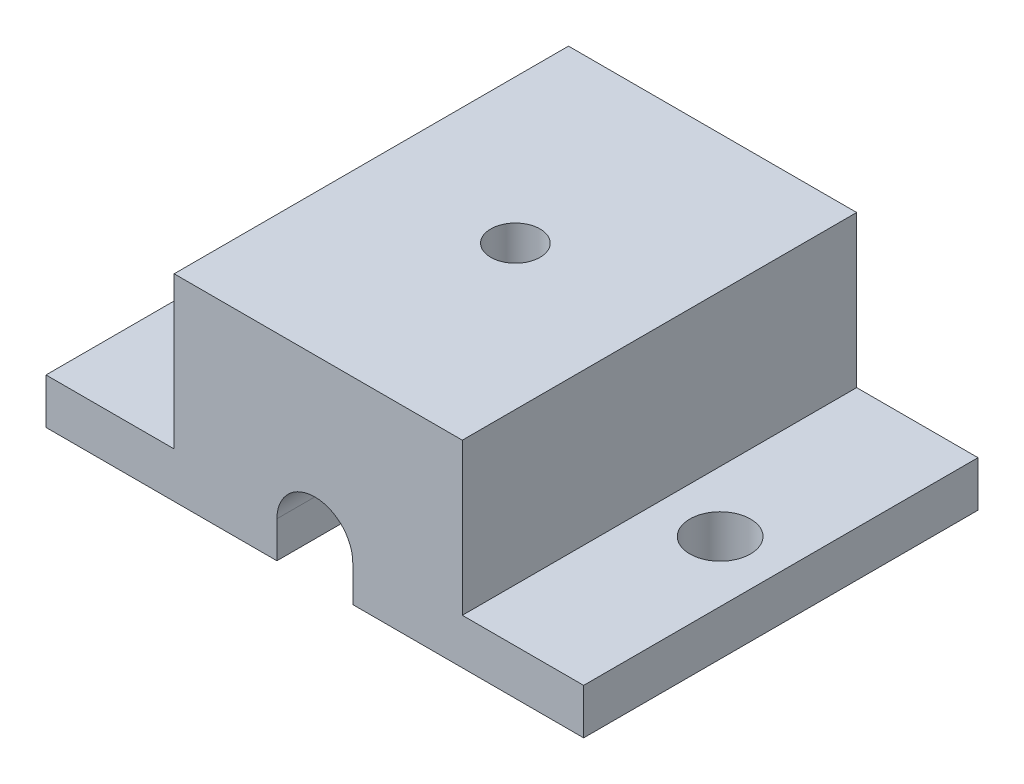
from build123d import *

# Parameters (mm, degrees)
BOSS_EXTRUDE1_DEPTH = 26
SKETCH2_R           = 2
CUT_EXTRUDE1_DEPTH  = 20
CUT_EXTRUDE2_DEPTH  = 46.84302394
SKETCH6_R           = 1.625
CUT_EXTRUDE3_DEPTH  = 46.84302394


with BuildPart() as part:
    # Sketch1 → Boss-Extrude1 (new body)
    with BuildSketch(Plane.XY):
        Polygon((35.448312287, 0), (35.448312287, 3), (27.448312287, 3), (27.448312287, 13), (8.448312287, 13), (8.448312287, 3), (0, 3), (0, 0), align=None)
    extrude(amount=BOSS_EXTRUDE1_DEPTH)

    # Sketch2 → Cut-Extrude1 (cut)
    with BuildSketch(Plane(origin=(0, 3, 0), x_dir=(1, 0, 0), z_dir=(0, 1, 0))):
        with Locations(Location((4, -13, 0), (0, 0, 270))):
            Circle(SKETCH2_R)
        with Locations(Location((31.448312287, -13, 0), (0, 0, 270))):
            Circle(SKETCH2_R)
    extrude(amount=-CUT_EXTRUDE1_DEPTH, mode=Mode.SUBTRACT)

    # Sketch4 → Cut-Extrude2 (cut, through all)
    with BuildSketch(Plane(origin=(0, 0, 0), x_dir=(-1, 0, 0), z_dir=(0, 0, -1))):
        with BuildLine():
            Line((-20.225, 2.4), (-20.225, 0))
            Line((-20.225, 0), (-15.225, 0))
            Line((-15.225, 0), (-15.225, 2.4))
            ThreePointArc((-15.225, 2.4), (-17.725, 4.9), (-20.225, 2.4))
        make_face()
    extrude(amount=-CUT_EXTRUDE2_DEPTH, mode=Mode.SUBTRACT)

    # Sketch6 → Cut-Extrude3 (cut, through all)
    with BuildSketch(Plane(origin=(0, 13, 0), x_dir=(1, 0, 0), z_dir=(0, 1, 0))):
        with Locations(Location((17.948312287, -13, 0), (0, 0, 270))):
            Circle(SKETCH6_R)
    extrude(amount=-CUT_EXTRUDE3_DEPTH, mode=Mode.SUBTRACT)


solid = part.part
